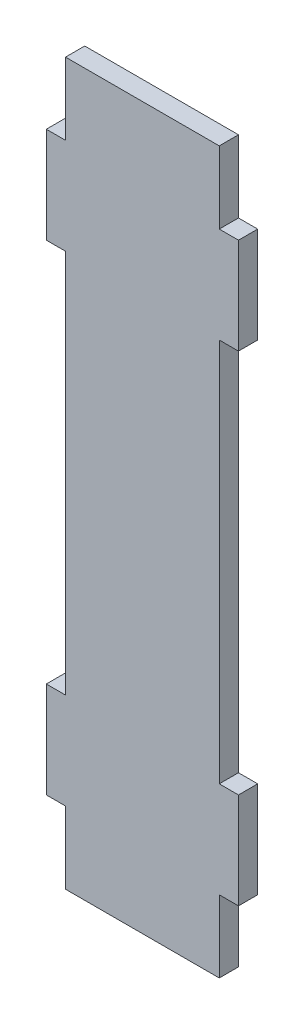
from build123d import *

# Parameters (mm, degrees)
BOSS_EXTRUDE2_DEPTH = 4


with BuildPart() as part:
    # Sketch1 → Boss-Extrude2 (new body)
    with BuildSketch(Plane.XY):
        Polygon((16, 135), (20, 135), (20, 115), (16, 115), (16, 35), (20, 35), (20, 15), (16, 15), (16, 0), (-16, 0), (-16, 15), (-20, 15), (-20, 35), (-16, 35), (-16, 115), (-20, 115), (-20, 135), (-16, 135), (-16, 150), (16, 150), align=None)
    extrude(amount=BOSS_EXTRUDE2_DEPTH)


solid = part.part
